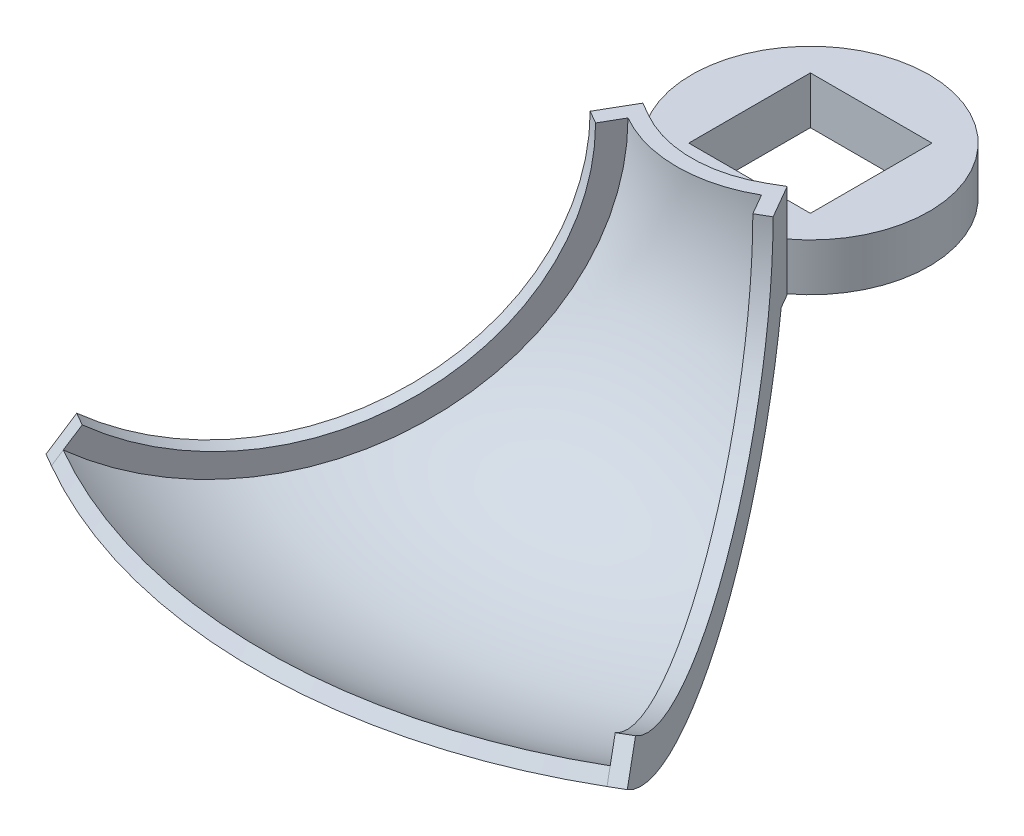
from build123d import *

# Parameters (mm, degrees)
SKETCH1_R           = 40
BOSS_EXTRUDE1_DEPTH = 16
SKETCH2_W           = 41
SKETCH2_H           = 41
CUT_EXTRUDE1_DEPTH  = 59.787753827
BOSS_EXTRUDE2_DEPTH = 5
BOSS_EXTRUDE3_DEPTH = 5


with BuildPart() as part:
    # Sketch1 → Boss-Extrude1 (new body)
    with BuildSketch(Plane(origin=(0, 0, 0), x_dir=(1, 0, 0), z_dir=(0, 1, 0))):
        with Locations(Location((0, 0, 0), (0, 0, 270))):
            Circle(SKETCH1_R)
    extrude(amount=BOSS_EXTRUDE1_DEPTH)

    # Sketch2 → Cut-Extrude1 (cut, through all)
    with BuildSketch(Plane(origin=(0, 16, 0), x_dir=(1, 0, 0), z_dir=(0, 1, 0))):
        Rectangle(SKETCH2_W, SKETCH2_H)
    extrude(amount=-CUT_EXTRUDE1_DEPTH, mode=Mode.SUBTRACT)

    # Sweep1: sweep along a path in Sketch10
    with BuildLine(Plane(origin=(0, 16, 0), x_dir=(1, 0, 0), z_dir=(0, 1, 0))) as sweep1_path:
        ThreePointArc((-20, -34.641016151), (0, -40), (20, -34.641016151))
    # Sketch3 → Sweep1 (sweep)
    with BuildSketch(Plane.ZY):
        with BuildLine():
            Line((40, 0), (40, 16))
            Line((40, 16), (40, 31.584891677))
            Line((40, 31.584891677), (45, 31.584891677))
            ThreePointArc((45, 31.584891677), (92.852664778, -46.723418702), (184.367988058, -39.866698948))
            Line((184.367988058, -39.866698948), (187.286623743, -43.926448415))
            ThreePointArc((187.286623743, -43.926448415), (105.473564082, -57.24807138), (45.527749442, 0))
            Line((45.527749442, 0), (40, 0))
        make_face()
    sweep(path=sweep1_path.line)

    # Sketch11 → Boss-Extrude2 (add)
    with BuildSketch(Plane(origin=(0, 0, 0), x_dir=(-0.5000000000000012, 0, -0.8660254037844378), z_dir=(0.8660254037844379, 0, -0.5000000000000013))):
        with BuildLine():
            Line((-184.367988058, -39.866698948), (-179.698170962, -33.3710998))
            ThreePointArc((-179.698170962, -33.3710998), (-96.502422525, -39.604481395), (-53, 31.584891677))
            Line((-53, 31.584891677), (-45, 31.584891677))
            Line((-45, 31.584891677), (-40, 31.584891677))
            Line((-40, 31.584891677), (-40, 16))
            Line((-40, 16), (-40, 0))
            Line((-40, 0), (-45.527749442, 0))
            ThreePointArc((-45.527749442, 0), (-105.473564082, -57.24807138), (-187.286623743, -43.926448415))
            Line((-187.286623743, -43.926448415), (-184.367988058, -39.866698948))
        make_face()
    extrude(amount=BOSS_EXTRUDE2_DEPTH)

    # Sketch12 → Boss-Extrude3 (add)
    with BuildSketch(Plane(origin=(0, 0, 0), x_dir=(-0.5000000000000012, 0, 0.866025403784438), z_dir=(-0.866025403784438, 0, -0.5000000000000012))):
        with BuildLine():
            Line((45, 31.584891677), (53, 31.584891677))
            ThreePointArc((53, 31.584891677), (96.502422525, -39.604481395), (179.698170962, -33.3710998))
            Line((179.698170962, -33.3710998), (184.367988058, -39.866698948))
            Line((184.367988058, -39.866698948), (187.286623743, -43.926448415))
            ThreePointArc((187.286623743, -43.926448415), (105.473564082, -57.24807138), (45.527749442, 0))
            Line((45.527749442, 0), (40, 0))
            Line((40, 0), (40, 16))
            Line((40, 16), (40, 31.584891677))
            Line((40, 31.584891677), (45, 31.584891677))
        make_face()
    extrude(amount=BOSS_EXTRUDE3_DEPTH)


solid = part.part
